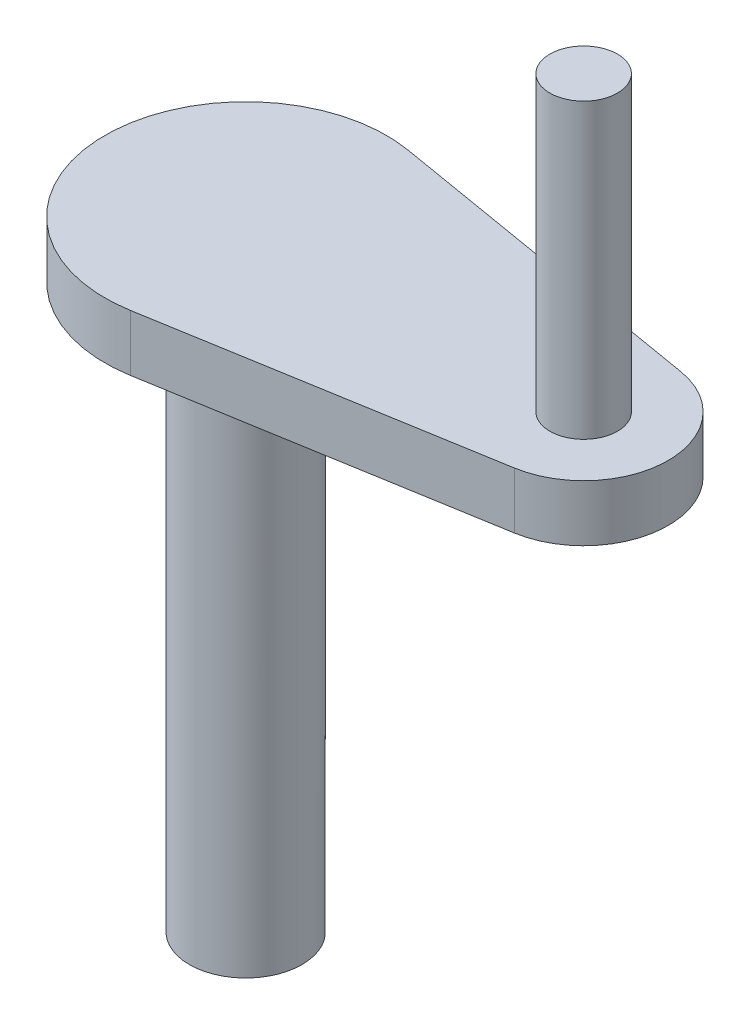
ISO-10303-21;
HEADER;
FILE_DESCRIPTION(('STEP AP214'),'2;1');
FILE_NAME('part.step','',(''),(''),'','','');
FILE_SCHEMA(('AUTOMOTIVE_DESIGN { 1 0 10303 214 1 1 1 1 }'));
ENDSEC;
DATA;
#1=APPLICATION_CONTEXT('core data for automotive mechanical design processes');
#2=APPLICATION_PROTOCOL_DEFINITION('international standard','automotive_design',2000,#1);
#3=PRODUCT_CONTEXT('',#1,'mechanical');
#4=PRODUCT('Part','Part','',(#3));
#5=PRODUCT_RELATED_PRODUCT_CATEGORY('part','',(#4));
#6=PRODUCT_DEFINITION_FORMATION('','',#4);
#7=PRODUCT_DEFINITION_CONTEXT('part definition',#1,'design');
#8=PRODUCT_DEFINITION('design','',#6,#7);
#9=PRODUCT_DEFINITION_SHAPE('','',#8);
#10=(LENGTH_UNIT() NAMED_UNIT(*) SI_UNIT(.MILLI.,.METRE.));
#11=(NAMED_UNIT(*) PLANE_ANGLE_UNIT() SI_UNIT($,.RADIAN.));
#12=(NAMED_UNIT(*) SI_UNIT($,.STERADIAN.) SOLID_ANGLE_UNIT());
#13=UNCERTAINTY_MEASURE_WITH_UNIT(LENGTH_MEASURE(1.E-05),#10,'distance_accuracy_value','');
#14=(GEOMETRIC_REPRESENTATION_CONTEXT(3) GLOBAL_UNCERTAINTY_ASSIGNED_CONTEXT((#13)) GLOBAL_UNIT_ASSIGNED_CONTEXT((#10,
#11,#12)) REPRESENTATION_CONTEXT('',''));
#15=CARTESIAN_POINT('',(0.,0.,0.));
#16=DIRECTION('',(0.,0.,1.));
#17=DIRECTION('',(1.,0.,0.));
#18=AXIS2_PLACEMENT_3D('',#15,#16,#17);
#19=CARTESIAN_POINT('',(-84.2443904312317,90.3761298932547,0.));
#20=DIRECTION('',(0.,1.,0.));
#21=DIRECTION('',(0.,0.,1.));
#22=AXIS2_PLACEMENT_3D('',#19,#20,#21);
#23=PLANE('',#22);
#24=CARTESIAN_POINT('',(37.8596665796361,90.3761298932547,0.));
#25=DIRECTION('',(0.,1.,0.));
#26=DIRECTION('',(0.,0.,1.));
#27=AXIS2_PLACEMENT_3D('',#24,#25,#26);
#28=CIRCLE('',#27,15.);
#29=CARTESIAN_POINT('',(40.3596665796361,90.3761298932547,-14.7901994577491));
#30=VERTEX_POINT('',#29);
#31=CARTESIAN_POINT('',(40.3596665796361,90.3761298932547,14.790199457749));
#32=VERTEX_POINT('',#31);
#33=EDGE_CURVE('E179',#30,#32,#28,.F.);
#34=ORIENTED_EDGE('',*,*,#33,.T.);
#35=DIRECTION('',(-0.986013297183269,0.,0.166666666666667));
#36=VECTOR('',#35,1.);
#37=CARTESIAN_POINT('',(-78.3526110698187,90.3761298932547,34.856236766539));
#38=LINE('',#37,#36);
#39=CARTESIAN_POINT('',(-17.9736667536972,90.3761298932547,24.6503324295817));
#40=VERTEX_POINT('',#39);
#41=EDGE_CURVE('E191',#32,#40,#38,.T.);
#42=ORIENTED_EDGE('',*,*,#41,.T.);
#43=CARTESIAN_POINT('',(-22.1403334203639,90.3761298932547,0.));
#44=DIRECTION('',(0.,1.,0.));
#45=DIRECTION('',(0.,0.,1.));
#46=AXIS2_PLACEMENT_3D('',#43,#44,#45);
#47=CIRCLE('',#46,25.);
#48=CARTESIAN_POINT('',(-17.9736667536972,90.3761298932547,-24.6503324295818));
#49=VERTEX_POINT('',#48);
#50=EDGE_CURVE('E181',#49,#40,#47,.T.);
#51=ORIENTED_EDGE('',*,*,#50,.F.);
#52=DIRECTION('',(-0.986013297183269,0.,-0.166666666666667));
#53=VECTOR('',#52,1.);
#54=CARTESIAN_POINT('',(-78.3526110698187,90.3761298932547,-34.856236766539));
#55=LINE('',#54,#53);
#56=EDGE_CURVE('E167',#30,#49,#55,.T.);
#57=ORIENTED_EDGE('',*,*,#56,.F.);
#58=EDGE_LOOP('',(#34,#42,#51,#57));
#59=FACE_BOUND('',#58,.T.);
#60=CARTESIAN_POINT('',(-22.1403334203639,90.3761298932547,0.));
#61=DIRECTION('',(0.,1.,0.));
#62=DIRECTION('',(0.,0.,1.));
#63=AXIS2_PLACEMENT_3D('',#60,#61,#62);
#64=CIRCLE('',#63,10.);
#65=CARTESIAN_POINT('',(-22.1403334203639,90.3761298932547,10.));
#66=VERTEX_POINT('',#65);
#67=EDGE_CURVE('E59',#66,#66,#64,.F.);
#68=ORIENTED_EDGE('',*,*,#67,.F.);
#69=EDGE_LOOP('',(#68));
#70=FACE_BOUND('',#69,.T.);
#71=ADVANCED_FACE('F122',(#59,#70),#23,.F.);
#72=CARTESIAN_POINT('',(-84.2443904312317,100.376129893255,0.));
#73=DIRECTION('',(0.,1.,0.));
#74=DIRECTION('',(0.,0.,1.));
#75=AXIS2_PLACEMENT_3D('',#72,#73,#74);
#76=PLANE('',#75);
#77=CARTESIAN_POINT('',(37.8596665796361,100.376129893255,0.));
#78=DIRECTION('',(0.,1.,0.));
#79=DIRECTION('',(0.,0.,1.));
#80=AXIS2_PLACEMENT_3D('',#77,#78,#79);
#81=CIRCLE('',#80,15.);
#82=CARTESIAN_POINT('',(40.3596665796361,100.376129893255,-14.7901994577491));
#83=VERTEX_POINT('',#82);
#84=CARTESIAN_POINT('',(40.3596665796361,100.376129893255,14.790199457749));
#85=VERTEX_POINT('',#84);
#86=EDGE_CURVE('E193',#83,#85,#81,.F.);
#87=ORIENTED_EDGE('',*,*,#86,.F.);
#88=DIRECTION('',(-0.986013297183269,0.,-0.166666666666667));
#89=VECTOR('',#88,1.);
#90=CARTESIAN_POINT('',(-78.3526110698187,100.376129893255,-34.856236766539));
#91=LINE('',#90,#89);
#92=CARTESIAN_POINT('',(-17.9736667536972,100.376129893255,-24.6503324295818));
#93=VERTEX_POINT('',#92);
#94=EDGE_CURVE('E169',#83,#93,#91,.T.);
#95=ORIENTED_EDGE('',*,*,#94,.T.);
#96=CARTESIAN_POINT('',(-22.1403334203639,100.376129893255,0.));
#97=DIRECTION('',(0.,1.,0.));
#98=DIRECTION('',(0.,0.,1.));
#99=AXIS2_PLACEMENT_3D('',#96,#97,#98);
#100=CIRCLE('',#99,25.);
#101=CARTESIAN_POINT('',(-17.9736667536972,100.376129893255,24.6503324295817));
#102=VERTEX_POINT('',#101);
#103=EDGE_CURVE('E145',#93,#102,#100,.T.);
#104=ORIENTED_EDGE('',*,*,#103,.T.);
#105=DIRECTION('',(-0.986013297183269,0.,0.166666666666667));
#106=VECTOR('',#105,1.);
#107=CARTESIAN_POINT('',(-78.3526110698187,100.376129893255,34.856236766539));
#108=LINE('',#107,#106);
#109=EDGE_CURVE('E197',#85,#102,#108,.T.);
#110=ORIENTED_EDGE('',*,*,#109,.F.);
#111=EDGE_LOOP('',(#87,#95,#104,#110));
#112=FACE_BOUND('',#111,.T.);
#113=CARTESIAN_POINT('',(37.8596665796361,100.376129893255,0.));
#114=DIRECTION('',(0.,1.,0.));
#115=DIRECTION('',(0.,0.,1.));
#116=AXIS2_PLACEMENT_3D('',#113,#114,#115);
#117=CIRCLE('',#116,5.99999999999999);
#118=CARTESIAN_POINT('',(37.8596665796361,100.376129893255,-5.99999999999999));
#119=VERTEX_POINT('',#118);
#120=EDGE_CURVE('E186',#119,#119,#117,.T.);
#121=ORIENTED_EDGE('',*,*,#120,.F.);
#122=EDGE_LOOP('',(#121));
#123=FACE_BOUND('',#122,.T.);
#124=ADVANCED_FACE('F205',(#112,#123),#76,.T.);
#125=CARTESIAN_POINT('',(37.8596665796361,100.376129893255,0.));
#126=DIRECTION('',(0.,-1.,0.));
#127=DIRECTION('',(0.,0.,-1.));
#128=AXIS2_PLACEMENT_3D('',#125,#126,#127);
#129=CYLINDRICAL_SURFACE('',#128,15.);
#130=ORIENTED_EDGE('',*,*,#33,.F.);
#131=DIRECTION('',(0.,-1.,0.));
#132=VECTOR('',#131,1.);
#133=CARTESIAN_POINT('',(40.3596665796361,100.376129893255,-14.7901994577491));
#134=LINE('',#133,#132);
#135=EDGE_CURVE('E130',#83,#30,#134,.T.);
#136=ORIENTED_EDGE('',*,*,#135,.F.);
#137=ORIENTED_EDGE('',*,*,#86,.T.);
#138=DIRECTION('',(0.,-1.,0.));
#139=VECTOR('',#138,1.);
#140=CARTESIAN_POINT('',(40.3596665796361,100.376129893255,14.790199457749));
#141=LINE('',#140,#139);
#142=EDGE_CURVE('E137',#85,#32,#141,.T.);
#143=ORIENTED_EDGE('',*,*,#142,.T.);
#144=EDGE_LOOP('',(#130,#136,#137,#143));
#145=FACE_BOUND('',#144,.T.);
#146=ADVANCED_FACE('F124',(#145),#129,.T.);
#147=CARTESIAN_POINT('',(-78.3526110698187,100.376129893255,-34.856236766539));
#148=DIRECTION('',(-0.166666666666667,0.,0.986013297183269));
#149=DIRECTION('',(0.986013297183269,0.,0.166666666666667));
#150=AXIS2_PLACEMENT_3D('',#147,#148,#149);
#151=PLANE('',#150);
#152=ORIENTED_EDGE('',*,*,#56,.T.);
#153=DIRECTION('',(0.,-1.,0.));
#154=VECTOR('',#153,1.);
#155=CARTESIAN_POINT('',(-17.9736667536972,100.376129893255,-24.6503324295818));
#156=LINE('',#155,#154);
#157=EDGE_CURVE('E173',#93,#49,#156,.T.);
#158=ORIENTED_EDGE('',*,*,#157,.F.);
#159=ORIENTED_EDGE('',*,*,#94,.F.);
#160=ORIENTED_EDGE('',*,*,#135,.T.);
#161=EDGE_LOOP('',(#152,#158,#159,#160));
#162=FACE_BOUND('',#161,.T.);
#163=ADVANCED_FACE('F165',(#162),#151,.F.);
#164=CARTESIAN_POINT('',(-22.1403334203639,100.376129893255,0.));
#165=DIRECTION('',(0.,-1.,0.));
#166=DIRECTION('',(0.,0.,-1.));
#167=AXIS2_PLACEMENT_3D('',#164,#165,#166);
#168=CYLINDRICAL_SURFACE('',#167,25.);
#169=ORIENTED_EDGE('',*,*,#50,.T.);
#170=DIRECTION('',(0.,-1.,0.));
#171=VECTOR('',#170,1.);
#172=CARTESIAN_POINT('',(-17.9736667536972,100.376129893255,24.6503324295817));
#173=LINE('',#172,#171);
#174=EDGE_CURVE('E200',#102,#40,#173,.T.);
#175=ORIENTED_EDGE('',*,*,#174,.F.);
#176=ORIENTED_EDGE('',*,*,#103,.F.);
#177=ORIENTED_EDGE('',*,*,#157,.T.);
#178=EDGE_LOOP('',(#169,#175,#176,#177));
#179=FACE_BOUND('',#178,.T.);
#180=ADVANCED_FACE('F203',(#179),#168,.T.);
#181=CARTESIAN_POINT('',(-78.3526110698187,100.376129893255,34.856236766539));
#182=DIRECTION('',(0.166666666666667,0.,0.986013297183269));
#183=DIRECTION('',(0.986013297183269,0.,-0.166666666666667));
#184=AXIS2_PLACEMENT_3D('',#181,#182,#183);
#185=PLANE('',#184);
#186=ORIENTED_EDGE('',*,*,#41,.F.);
#187=ORIENTED_EDGE('',*,*,#142,.F.);
#188=ORIENTED_EDGE('',*,*,#109,.T.);
#189=ORIENTED_EDGE('',*,*,#174,.T.);
#190=EDGE_LOOP('',(#186,#187,#188,#189));
#191=FACE_BOUND('',#190,.T.);
#192=ADVANCED_FACE('F204',(#191),#185,.T.);
#193=CARTESIAN_POINT('',(37.8596665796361,152.376129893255,0.));
#194=DIRECTION('',(0.,-1.,0.));
#195=DIRECTION('',(0.,0.,-1.));
#196=AXIS2_PLACEMENT_3D('',#193,#194,#195);
#197=CYLINDRICAL_SURFACE('',#196,5.99999999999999);
#198=CARTESIAN_POINT('',(37.8596665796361,152.376129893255,0.));
#199=DIRECTION('',(0.,1.,0.));
#200=DIRECTION('',(0.,0.,1.));
#201=AXIS2_PLACEMENT_3D('',#198,#199,#200);
#202=CIRCLE('',#201,5.99999999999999);
#203=CARTESIAN_POINT('',(37.8596665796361,152.376129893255,-5.99999999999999));
#204=VERTEX_POINT('',#203);
#205=EDGE_CURVE('E183',#204,#204,#202,.T.);
#206=CARTESIAN_POINT('',(37.8596665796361,152.376129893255,-5.99999999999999));
#207=CARTESIAN_POINT('',(37.8596665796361,151.834463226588,-5.99999999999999));
#208=CARTESIAN_POINT('',(37.8596665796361,151.292796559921,-5.99999999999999));
#209=CARTESIAN_POINT('',(37.8596665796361,150.209463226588,-5.99999999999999));
#210=CARTESIAN_POINT('',(37.8596665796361,149.667796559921,-5.99999999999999));
#211=CARTESIAN_POINT('',(37.8596665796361,148.584463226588,-5.99999999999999));
#212=CARTESIAN_POINT('',(37.8596665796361,148.042796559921,-5.99999999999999));
#213=CARTESIAN_POINT('',(37.8596665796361,146.959463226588,-5.99999999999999));
#214=CARTESIAN_POINT('',(37.8596665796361,146.417796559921,-5.99999999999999));
#215=CARTESIAN_POINT('',(37.8596665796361,145.334463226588,-5.99999999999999));
#216=CARTESIAN_POINT('',(37.8596665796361,144.792796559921,-5.99999999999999));
#217=CARTESIAN_POINT('',(37.8596665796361,143.709463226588,-5.99999999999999));
#218=CARTESIAN_POINT('',(37.8596665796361,143.167796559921,-5.99999999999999));
#219=CARTESIAN_POINT('',(37.8596665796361,142.084463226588,-5.99999999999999));
#220=CARTESIAN_POINT('',(37.8596665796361,141.542796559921,-5.99999999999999));
#221=CARTESIAN_POINT('',(37.8596665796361,140.459463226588,-5.99999999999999));
#222=CARTESIAN_POINT('',(37.8596665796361,139.917796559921,-5.99999999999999));
#223=CARTESIAN_POINT('',(37.8596665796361,138.834463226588,-5.99999999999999));
#224=CARTESIAN_POINT('',(37.8596665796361,138.292796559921,-5.99999999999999));
#225=CARTESIAN_POINT('',(37.8596665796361,137.209463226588,-5.99999999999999));
#226=CARTESIAN_POINT('',(37.8596665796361,136.667796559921,-5.99999999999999));
#227=CARTESIAN_POINT('',(37.8596665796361,135.584463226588,-5.99999999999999));
#228=CARTESIAN_POINT('',(37.8596665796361,135.042796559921,-5.99999999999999));
#229=CARTESIAN_POINT('',(37.8596665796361,133.959463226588,-5.99999999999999));
#230=CARTESIAN_POINT('',(37.8596665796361,133.417796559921,-5.99999999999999));
#231=CARTESIAN_POINT('',(37.8596665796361,132.334463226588,-5.99999999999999));
#232=CARTESIAN_POINT('',(37.8596665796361,131.792796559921,-5.99999999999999));
#233=CARTESIAN_POINT('',(37.8596665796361,130.709463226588,-5.99999999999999));
#234=CARTESIAN_POINT('',(37.8596665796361,130.167796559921,-5.99999999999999));
#235=CARTESIAN_POINT('',(37.8596665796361,129.084463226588,-5.99999999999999));
#236=CARTESIAN_POINT('',(37.8596665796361,128.542796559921,-5.99999999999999));
#237=CARTESIAN_POINT('',(37.8596665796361,127.459463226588,-5.99999999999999));
#238=CARTESIAN_POINT('',(37.8596665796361,126.917796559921,-5.99999999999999));
#239=CARTESIAN_POINT('',(37.8596665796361,125.834463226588,-5.99999999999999));
#240=CARTESIAN_POINT('',(37.8596665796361,125.292796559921,-5.99999999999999));
#241=CARTESIAN_POINT('',(37.8596665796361,124.209463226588,-5.99999999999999));
#242=CARTESIAN_POINT('',(37.8596665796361,123.667796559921,-5.99999999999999));
#243=CARTESIAN_POINT('',(37.8596665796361,122.584463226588,-5.99999999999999));
#244=CARTESIAN_POINT('',(37.8596665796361,122.042796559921,-5.99999999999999));
#245=CARTESIAN_POINT('',(37.8596665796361,120.959463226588,-5.99999999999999));
#246=CARTESIAN_POINT('',(37.8596665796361,120.417796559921,-5.99999999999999));
#247=CARTESIAN_POINT('',(37.8596665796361,119.334463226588,-5.99999999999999));
#248=CARTESIAN_POINT('',(37.8596665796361,118.792796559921,-5.99999999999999));
#249=CARTESIAN_POINT('',(37.8596665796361,117.709463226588,-5.99999999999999));
#250=CARTESIAN_POINT('',(37.8596665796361,117.167796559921,-5.99999999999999));
#251=CARTESIAN_POINT('',(37.8596665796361,116.084463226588,-5.99999999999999));
#252=CARTESIAN_POINT('',(37.8596665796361,115.542796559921,-5.99999999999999));
#253=CARTESIAN_POINT('',(37.8596665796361,114.459463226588,-5.99999999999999));
#254=CARTESIAN_POINT('',(37.8596665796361,113.917796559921,-5.99999999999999));
#255=CARTESIAN_POINT('',(37.8596665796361,112.834463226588,-5.99999999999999));
#256=CARTESIAN_POINT('',(37.8596665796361,112.292796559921,-5.99999999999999));
#257=CARTESIAN_POINT('',(37.8596665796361,111.209463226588,-5.99999999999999));
#258=CARTESIAN_POINT('',(37.8596665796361,110.667796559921,-5.99999999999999));
#259=CARTESIAN_POINT('',(37.8596665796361,109.584463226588,-5.99999999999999));
#260=CARTESIAN_POINT('',(37.8596665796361,109.042796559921,-5.99999999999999));
#261=CARTESIAN_POINT('',(37.8596665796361,107.959463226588,-5.99999999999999));
#262=CARTESIAN_POINT('',(37.8596665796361,107.417796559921,-5.99999999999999));
#263=CARTESIAN_POINT('',(37.8596665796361,106.334463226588,-5.99999999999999));
#264=CARTESIAN_POINT('',(37.8596665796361,105.792796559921,-5.99999999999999));
#265=CARTESIAN_POINT('',(37.8596665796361,104.709463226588,-5.99999999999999));
#266=CARTESIAN_POINT('',(37.8596665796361,104.167796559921,-5.99999999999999));
#267=CARTESIAN_POINT('',(37.8596665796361,103.084463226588,-5.99999999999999));
#268=CARTESIAN_POINT('',(37.8596665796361,102.542796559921,-5.99999999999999));
#269=CARTESIAN_POINT('',(37.8596665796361,101.459463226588,-5.99999999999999));
#270=CARTESIAN_POINT('',(37.8596665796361,100.917796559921,-5.99999999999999));
#271=CARTESIAN_POINT('',(37.8596665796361,100.376129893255,-5.99999999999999));
#272=B_SPLINE_CURVE_WITH_KNOTS('',3,(#206,#207,#208,#209,#210,#211,#212,#213,#214,#215,#216,
#217,#218,#219,#220,#221,#222,#223,#224,#225,#226,#227,#228,#229,#230,#231,#232,#233,#234,#235,
#236,#237,#238,#239,#240,#241,#242,#243,#244,#245,#246,#247,#248,#249,#250,#251,#252,#253,#254,
#255,#256,#257,#258,#259,#260,#261,#262,#263,#264,#265,#266,#267,#268,#269,#270,#271),
.UNSPECIFIED.,.F.,.F.,(4,2,2,2,2,2,2,2,2,2,2,2,2,2,2,2,2,2,2,2,2,2,2,2,2,2,2,2,2,2,2,2,4),(0.,
1.62499999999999,3.24999999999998,4.87499999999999,6.49999999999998,8.12499999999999,
9.74999999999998,11.375,13.,14.625,16.25,17.875,19.5,21.125,22.75,24.375,26.,27.625,29.25,
30.875,32.5,34.125,35.75,37.375,39.,40.625,42.25,43.875,45.5,47.125,48.75,50.375,52.),.UNSPECIFIED.);
#273=EDGE_CURVE('BSEAM230',#204,#119,#272,.T.);
#274=ORIENTED_EDGE('',*,*,#205,.F.);
#275=ORIENTED_EDGE('',*,*,#120,.T.);
#276=ORIENTED_EDGE('',*,*,#273,.T.);
#277=ORIENTED_EDGE('',*,*,#273,.F.);
#278=EDGE_LOOP('',(#274,#276,#275,#277));
#279=FACE_BOUND('',#278,.T.);
#280=ADVANCED_FACE('F230',(#279),#197,.T.);
#281=CARTESIAN_POINT('',(37.8596665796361,152.376129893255,0.));
#282=DIRECTION('',(0.,1.,0.));
#283=DIRECTION('',(0.,0.,1.));
#284=AXIS2_PLACEMENT_3D('',#281,#282,#283);
#285=PLANE('',#284);
#286=ORIENTED_EDGE('',*,*,#205,.T.);
#287=EDGE_LOOP('',(#286));
#288=FACE_BOUND('',#287,.T.);
#289=ADVANCED_FACE('F222',(#288),#285,.T.);
#290=CARTESIAN_POINT('',(-22.1403334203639,-9.62387010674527,0.));
#291=DIRECTION('',(0.,1.,0.));
#292=DIRECTION('',(0.,0.,1.));
#293=AXIS2_PLACEMENT_3D('',#290,#291,#292);
#294=CYLINDRICAL_SURFACE('',#293,10.);
#295=CARTESIAN_POINT('',(-22.1403334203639,-9.62387010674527,0.));
#296=DIRECTION('',(0.,-1.,0.));
#297=DIRECTION('',(0.,0.,-1.));
#298=AXIS2_PLACEMENT_3D('',#295,#296,#297);
#299=CIRCLE('',#298,10.);
#300=CARTESIAN_POINT('',(-22.1403334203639,-9.62387010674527,-10.));
#301=VERTEX_POINT('',#300);
#302=EDGE_CURVE('E212',#301,#301,#299,.T.);
#303=ORIENTED_EDGE('',*,*,#302,.F.);
#304=EDGE_LOOP('',(#303));
#305=FACE_BOUND('',#304,.T.);
#306=ORIENTED_EDGE('',*,*,#67,.T.);
#307=EDGE_LOOP('',(#306));
#308=FACE_BOUND('',#307,.T.);
#309=ADVANCED_FACE('F219',(#305,#308),#294,.T.);
#310=CARTESIAN_POINT('',(-22.1403334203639,-9.62387010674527,0.));
#311=DIRECTION('',(0.,-1.,0.));
#312=DIRECTION('',(0.,0.,-1.));
#313=AXIS2_PLACEMENT_3D('',#310,#311,#312);
#314=PLANE('',#313);
#315=ORIENTED_EDGE('',*,*,#302,.T.);
#316=EDGE_LOOP('',(#315));
#317=FACE_BOUND('',#316,.T.);
#318=ADVANCED_FACE('F217',(#317),#314,.T.);
#319=CLOSED_SHELL('',(#71,#124,#146,#163,#180,#192,#280,#289,#309,#318));
#320=MANIFOLD_SOLID_BREP('B7',#319);
#321=ADVANCED_BREP_SHAPE_REPRESENTATION('',(#18,#320),#14);
#322=SHAPE_DEFINITION_REPRESENTATION(#9,#321);
ENDSEC;
END-ISO-10303-21;
